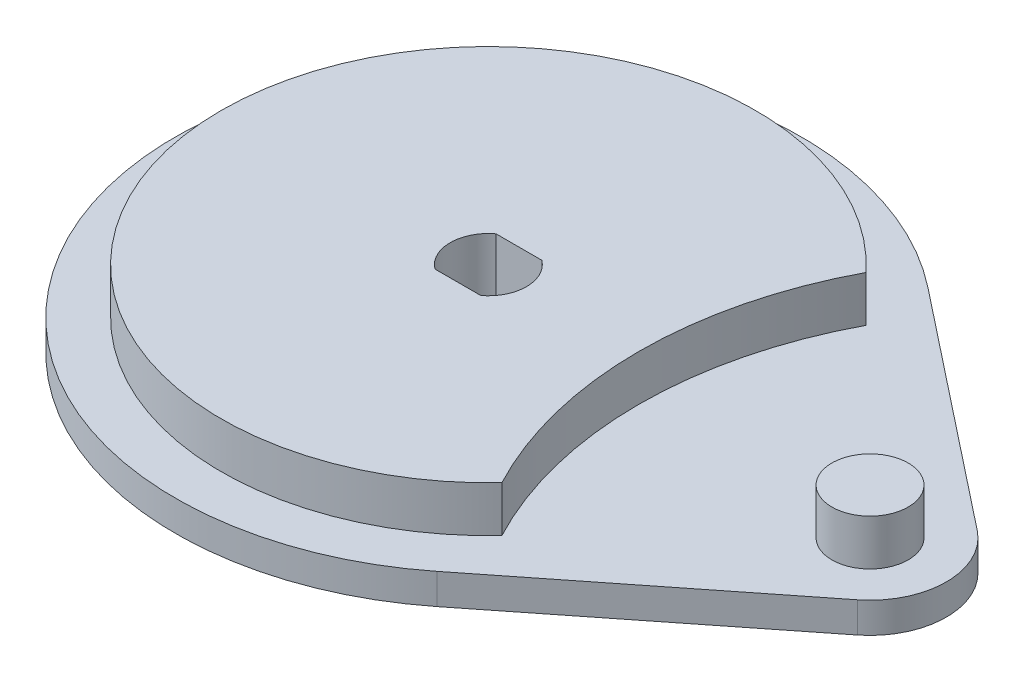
from build123d import *

# Parameters (mm, degrees)
EXTRUDE_1_DEPTH     = 4
SKETCH_3_R          = 35
EXTRUDE_2_DEPTH     = 10
SKETCH_4_R          = 51
CUT_EXTRUDE_1_DEPTH = 6
SKETCH_5_R          = 5
EXTRUDE_3_DEPTH     = 10
CUT_EXTRUDE_2_DEPTH = 74.35529974


with BuildPart() as part:
    # Sketch 2 → Extrude 1 (new body)
    with BuildSketch(Plane(origin=(0, 0, 0), x_dir=(1, 0, 0), z_dir=(0, 1, 0))):
        with BuildLine():
            Line((25.42, 32.168674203), (56.2, 7.846018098))
            ThreePointArc((56.2, 7.846018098), (60, 0), (56.2, -7.846018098))
            Line((56.2, -7.846018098), (25.42, -32.168674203))
            ThreePointArc((25.42, -32.168674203), (-41, 0), (25.42, 32.168674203))
        make_face()
    extrude(amount=EXTRUDE_1_DEPTH)

    # Sketch 3 → Extrude 2 (add)
    with BuildSketch(Plane(origin=(0, 0, 0), x_dir=(1, 0, 0), z_dir=(0, 1, 0))):
        with Locations(Location((0, 0, 0), (0, 0, 270))):
            Circle(SKETCH_3_R)
    extrude(amount=EXTRUDE_2_DEPTH)

    # Sketch 4 → Cut-Extrude 1 (cut)
    with BuildSketch(Plane(origin=(0, 10, 0), x_dir=(1, 0, 0), z_dir=(0, 1, 0))):
        with Locations((70.7, 0)):
            Circle(SKETCH_4_R)
    extrude(amount=-CUT_EXTRUDE_1_DEPTH, mode=Mode.SUBTRACT)

    # Sketch 5 → Extrude 3 (add)
    with BuildSketch(Plane(origin=(0, 0, 0), x_dir=(1, 0, 0), z_dir=(0, 1, 0))):
        with Locations(Location((50, 0, 0), (0, 0, 270))):
            Circle(SKETCH_5_R)
    extrude(amount=EXTRUDE_3_DEPTH)

    # Sketch 6 → Cut-Extrude 2 (cut, through all)
    with BuildSketch(Plane(origin=(0, 10, 0), x_dir=(1, 0, 0), z_dir=(0, 1, 0))):
        with BuildLine():
            Line((-3, 4), (3, 4))
            ThreePointArc((3, 4), (5, 0), (3, -4))
            Line((3, -4), (-3, -4))
            ThreePointArc((-3, -4), (-5, 0), (-3, 4))
        make_face()
    extrude(amount=-CUT_EXTRUDE_2_DEPTH, mode=Mode.SUBTRACT)


solid = part.part
